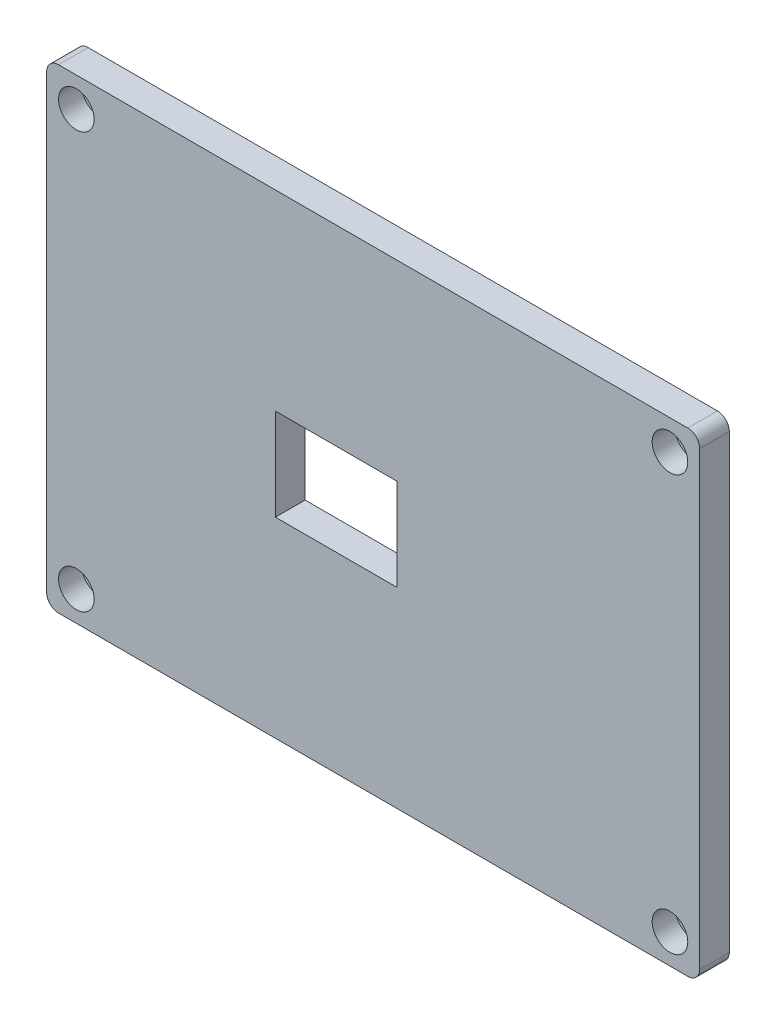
ISO-10303-21;
HEADER;
FILE_DESCRIPTION(('STEP AP214'),'2;1');
FILE_NAME('part.step','',(''),(''),'','','');
FILE_SCHEMA(('AUTOMOTIVE_DESIGN { 1 0 10303 214 1 1 1 1 }'));
ENDSEC;
DATA;
#1=APPLICATION_CONTEXT('core data for automotive mechanical design processes');
#2=APPLICATION_PROTOCOL_DEFINITION('international standard','automotive_design',2000,#1);
#3=PRODUCT_CONTEXT('',#1,'mechanical');
#4=PRODUCT('Part','Part','',(#3));
#5=PRODUCT_RELATED_PRODUCT_CATEGORY('part','',(#4));
#6=PRODUCT_DEFINITION_FORMATION('','',#4);
#7=PRODUCT_DEFINITION_CONTEXT('part definition',#1,'design');
#8=PRODUCT_DEFINITION('design','',#6,#7);
#9=PRODUCT_DEFINITION_SHAPE('','',#8);
#10=(LENGTH_UNIT() NAMED_UNIT(*) SI_UNIT(.MILLI.,.METRE.));
#11=(NAMED_UNIT(*) PLANE_ANGLE_UNIT() SI_UNIT($,.RADIAN.));
#12=(NAMED_UNIT(*) SI_UNIT($,.STERADIAN.) SOLID_ANGLE_UNIT());
#13=UNCERTAINTY_MEASURE_WITH_UNIT(LENGTH_MEASURE(1.E-05),#10,'distance_accuracy_value','');
#14=(GEOMETRIC_REPRESENTATION_CONTEXT(3) GLOBAL_UNCERTAINTY_ASSIGNED_CONTEXT((#13)) GLOBAL_UNIT_ASSIGNED_CONTEXT((#10,
#11,#12)) REPRESENTATION_CONTEXT('',''));
#15=CARTESIAN_POINT('',(0.,0.,0.));
#16=DIRECTION('',(0.,0.,1.));
#17=DIRECTION('',(1.,0.,0.));
#18=AXIS2_PLACEMENT_3D('',#15,#16,#17);
#19=CARTESIAN_POINT('',(-63.5,44.45,6.35));
#20=DIRECTION('',(0.,0.,-1.));
#21=DIRECTION('',(-1.,0.,0.));
#22=AXIS2_PLACEMENT_3D('',#19,#20,#21);
#23=CYLINDRICAL_SURFACE('',#22,2.47650000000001);
#24=CARTESIAN_POINT('',(-63.5,44.45,0.));
#25=DIRECTION('',(0.,0.,1.));
#26=DIRECTION('',(1.,0.,0.));
#27=AXIS2_PLACEMENT_3D('',#24,#25,#26);
#28=CIRCLE('',#27,2.47650000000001);
#29=CARTESIAN_POINT('',(-61.0235,44.45,0.));
#30=VERTEX_POINT('',#29);
#31=EDGE_CURVE('E197',#30,#30,#28,.T.);
#32=ORIENTED_EDGE('',*,*,#31,.F.);
#33=EDGE_LOOP('',(#32));
#34=FACE_BOUND('',#33,.T.);
#35=CARTESIAN_POINT('',(-63.5,44.45,1.397));
#36=DIRECTION('',(0.,0.,1.));
#37=DIRECTION('',(1.,0.,0.));
#38=AXIS2_PLACEMENT_3D('',#35,#36,#37);
#39=CIRCLE('',#38,2.47650000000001);
#40=CARTESIAN_POINT('',(-61.0235,44.45,1.397));
#41=VERTEX_POINT('',#40);
#42=EDGE_CURVE('E191',#41,#41,#39,.T.);
#43=ORIENTED_EDGE('',*,*,#42,.T.);
#44=EDGE_LOOP('',(#43));
#45=FACE_BOUND('',#44,.T.);
#46=ADVANCED_FACE('F35',(#34,#45),#23,.F.);
#47=CARTESIAN_POINT('',(63.5,44.45,6.35));
#48=DIRECTION('',(0.,0.,-1.));
#49=DIRECTION('',(-1.,0.,0.));
#50=AXIS2_PLACEMENT_3D('',#47,#48,#49);
#51=CYLINDRICAL_SURFACE('',#50,2.4765);
#52=CARTESIAN_POINT('',(63.5,44.45,0.));
#53=DIRECTION('',(0.,0.,1.));
#54=DIRECTION('',(1.,0.,0.));
#55=AXIS2_PLACEMENT_3D('',#52,#53,#54);
#56=CIRCLE('',#55,2.4765);
#57=CARTESIAN_POINT('',(65.9765,44.45,0.));
#58=VERTEX_POINT('',#57);
#59=EDGE_CURVE('E194',#58,#58,#56,.T.);
#60=ORIENTED_EDGE('',*,*,#59,.F.);
#61=EDGE_LOOP('',(#60));
#62=FACE_BOUND('',#61,.T.);
#63=CARTESIAN_POINT('',(63.5,44.45,1.397));
#64=DIRECTION('',(0.,0.,1.));
#65=DIRECTION('',(1.,0.,0.));
#66=AXIS2_PLACEMENT_3D('',#63,#64,#65);
#67=CIRCLE('',#66,2.4765);
#68=CARTESIAN_POINT('',(65.9765,44.45,1.397));
#69=VERTEX_POINT('',#68);
#70=EDGE_CURVE('E230',#69,#69,#67,.T.);
#71=ORIENTED_EDGE('',*,*,#70,.T.);
#72=EDGE_LOOP('',(#71));
#73=FACE_BOUND('',#72,.T.);
#74=ADVANCED_FACE('F310',(#62,#73),#51,.F.);
#75=CARTESIAN_POINT('',(63.5,-44.45,6.35));
#76=DIRECTION('',(0.,0.,-1.));
#77=DIRECTION('',(-1.,0.,0.));
#78=AXIS2_PLACEMENT_3D('',#75,#76,#77);
#79=CYLINDRICAL_SURFACE('',#78,2.4765);
#80=CARTESIAN_POINT('',(63.5,-44.45,0.));
#81=DIRECTION('',(0.,0.,1.));
#82=DIRECTION('',(1.,0.,0.));
#83=AXIS2_PLACEMENT_3D('',#80,#81,#82);
#84=CIRCLE('',#83,2.4765);
#85=CARTESIAN_POINT('',(65.9765,-44.45,0.));
#86=VERTEX_POINT('',#85);
#87=EDGE_CURVE('E190',#86,#86,#84,.T.);
#88=ORIENTED_EDGE('',*,*,#87,.F.);
#89=EDGE_LOOP('',(#88));
#90=FACE_BOUND('',#89,.T.);
#91=CARTESIAN_POINT('',(63.5,-44.45,1.397));
#92=DIRECTION('',(0.,0.,1.));
#93=DIRECTION('',(1.,0.,0.));
#94=AXIS2_PLACEMENT_3D('',#91,#92,#93);
#95=CIRCLE('',#94,2.4765);
#96=CARTESIAN_POINT('',(65.9765,-44.45,1.397));
#97=VERTEX_POINT('',#96);
#98=EDGE_CURVE('E227',#97,#97,#95,.T.);
#99=ORIENTED_EDGE('',*,*,#98,.T.);
#100=EDGE_LOOP('',(#99));
#101=FACE_BOUND('',#100,.T.);
#102=ADVANCED_FACE('F316',(#90,#101),#79,.F.);
#103=CARTESIAN_POINT('',(-63.5,-44.45,6.35));
#104=DIRECTION('',(0.,0.,-1.));
#105=DIRECTION('',(-1.,0.,0.));
#106=AXIS2_PLACEMENT_3D('',#103,#104,#105);
#107=CYLINDRICAL_SURFACE('',#106,2.47650000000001);
#108=CARTESIAN_POINT('',(-63.5,-44.45,0.));
#109=DIRECTION('',(0.,0.,1.));
#110=DIRECTION('',(1.,0.,0.));
#111=AXIS2_PLACEMENT_3D('',#108,#109,#110);
#112=CIRCLE('',#111,2.47650000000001);
#113=CARTESIAN_POINT('',(-61.0235,-44.45,0.));
#114=VERTEX_POINT('',#113);
#115=EDGE_CURVE('E187',#114,#114,#112,.T.);
#116=ORIENTED_EDGE('',*,*,#115,.F.);
#117=EDGE_LOOP('',(#116));
#118=FACE_BOUND('',#117,.T.);
#119=CARTESIAN_POINT('',(-63.5,-44.45,1.397));
#120=DIRECTION('',(0.,0.,1.));
#121=DIRECTION('',(1.,0.,0.));
#122=AXIS2_PLACEMENT_3D('',#119,#120,#121);
#123=CIRCLE('',#122,2.47650000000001);
#124=CARTESIAN_POINT('',(-61.0235,-44.45,1.397));
#125=VERTEX_POINT('',#124);
#126=EDGE_CURVE('E184',#125,#125,#123,.T.);
#127=ORIENTED_EDGE('',*,*,#126,.T.);
#128=EDGE_LOOP('',(#127));
#129=FACE_BOUND('',#128,.T.);
#130=ADVANCED_FACE('F325',(#118,#129),#107,.F.);
#131=CARTESIAN_POINT('',(0.,0.,6.35));
#132=DIRECTION('',(0.,0.,-1.));
#133=DIRECTION('',(-1.,0.,0.));
#134=AXIS2_PLACEMENT_3D('',#131,#132,#133);
#135=PLANE('',#134);
#136=DIRECTION('',(-1.,0.,0.));
#137=VECTOR('',#136,1.);
#138=CARTESIAN_POINT('',(0.,-9.8298,6.35));
#139=LINE('',#138,#137);
#140=CARTESIAN_POINT('',(5.10300896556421,-9.8298,6.35));
#141=VERTEX_POINT('',#140);
#142=CARTESIAN_POINT('',(-20.915750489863,-9.8298,6.35));
#143=VERTEX_POINT('',#142);
#144=EDGE_CURVE('E149',#141,#143,#139,.T.);
#145=ORIENTED_EDGE('',*,*,#144,.T.);
#146=DIRECTION('',(0.,1.,0.));
#147=VECTOR('',#146,1.);
#148=CARTESIAN_POINT('',(-20.915750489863,0.,6.35));
#149=LINE('',#148,#147);
#150=CARTESIAN_POINT('',(-20.915750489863,9.8298,6.35));
#151=VERTEX_POINT('',#150);
#152=EDGE_CURVE('E130',#143,#151,#149,.T.);
#153=ORIENTED_EDGE('',*,*,#152,.T.);
#154=DIRECTION('',(1.,0.,0.));
#155=VECTOR('',#154,1.);
#156=CARTESIAN_POINT('',(0.,9.8298,6.35));
#157=LINE('',#156,#155);
#158=CARTESIAN_POINT('',(5.10300896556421,9.8298,6.35));
#159=VERTEX_POINT('',#158);
#160=EDGE_CURVE('E158',#151,#159,#157,.T.);
#161=ORIENTED_EDGE('',*,*,#160,.T.);
#162=DIRECTION('',(0.,-1.,0.));
#163=VECTOR('',#162,1.);
#164=CARTESIAN_POINT('',(5.10300896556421,0.,6.35));
#165=LINE('',#164,#163);
#166=EDGE_CURVE('E155',#159,#141,#165,.T.);
#167=ORIENTED_EDGE('',*,*,#166,.T.);
#168=EDGE_LOOP('',(#145,#153,#161,#167));
#169=FACE_BOUND('',#168,.T.);
#170=CARTESIAN_POINT('',(63.5,-44.45,6.35));
#171=DIRECTION('',(0.,0.,1.));
#172=DIRECTION('',(1.,0.,0.));
#173=AXIS2_PLACEMENT_3D('',#170,#171,#172);
#174=CIRCLE('',#173,3.81);
#175=CARTESIAN_POINT('',(67.31,-44.45,6.35));
#176=VERTEX_POINT('',#175);
#177=EDGE_CURVE('E162',#176,#176,#174,.T.);
#178=ORIENTED_EDGE('',*,*,#177,.F.);
#179=EDGE_LOOP('',(#178));
#180=FACE_BOUND('',#179,.T.);
#181=CARTESIAN_POINT('',(63.5,44.45,6.35));
#182=DIRECTION('',(0.,0.,1.));
#183=DIRECTION('',(1.,0.,0.));
#184=AXIS2_PLACEMENT_3D('',#181,#182,#183);
#185=CIRCLE('',#184,3.81);
#186=CARTESIAN_POINT('',(67.31,44.45,6.35));
#187=VERTEX_POINT('',#186);
#188=EDGE_CURVE('E173',#187,#187,#185,.T.);
#189=ORIENTED_EDGE('',*,*,#188,.F.);
#190=EDGE_LOOP('',(#189));
#191=FACE_BOUND('',#190,.T.);
#192=CARTESIAN_POINT('',(-63.5,44.45,6.35));
#193=DIRECTION('',(0.,0.,1.));
#194=DIRECTION('',(1.,0.,0.));
#195=AXIS2_PLACEMENT_3D('',#192,#193,#194);
#196=CIRCLE('',#195,3.81);
#197=CARTESIAN_POINT('',(-59.69,44.45,6.35));
#198=VERTEX_POINT('',#197);
#199=EDGE_CURVE('E167',#198,#198,#196,.T.);
#200=ORIENTED_EDGE('',*,*,#199,.F.);
#201=EDGE_LOOP('',(#200));
#202=FACE_BOUND('',#201,.T.);
#203=CARTESIAN_POINT('',(-63.5,-44.45,6.35));
#204=DIRECTION('',(0.,0.,1.));
#205=DIRECTION('',(1.,0.,0.));
#206=AXIS2_PLACEMENT_3D('',#203,#204,#205);
#207=CIRCLE('',#206,3.81);
#208=CARTESIAN_POINT('',(-59.69,-44.45,6.35));
#209=VERTEX_POINT('',#208);
#210=EDGE_CURVE('E166',#209,#209,#207,.T.);
#211=ORIENTED_EDGE('',*,*,#210,.F.);
#212=EDGE_LOOP('',(#211));
#213=FACE_BOUND('',#212,.T.);
#214=DIRECTION('',(0.,1.,0.));
#215=VECTOR('',#214,1.);
#216=CARTESIAN_POINT('',(69.85,-50.8,6.35));
#217=LINE('',#216,#215);
#218=CARTESIAN_POINT('',(69.85,-48.26,6.35));
#219=VERTEX_POINT('',#218);
#220=CARTESIAN_POINT('',(69.85,48.26,6.35));
#221=VERTEX_POINT('',#220);
#222=EDGE_CURVE('E201',#219,#221,#217,.T.);
#223=ORIENTED_EDGE('',*,*,#222,.T.);
#224=CARTESIAN_POINT('',(67.31,48.26,6.35));
#225=DIRECTION('',(0.,0.,-1.));
#226=DIRECTION('',(-1.,0.,0.));
#227=AXIS2_PLACEMENT_3D('',#224,#225,#226);
#228=CIRCLE('',#227,2.54);
#229=CARTESIAN_POINT('',(67.31,50.8,6.35));
#230=VERTEX_POINT('',#229);
#231=EDGE_CURVE('E258',#221,#230,#228,.F.);
#232=ORIENTED_EDGE('',*,*,#231,.T.);
#233=DIRECTION('',(-1.,0.,0.));
#234=VECTOR('',#233,1.);
#235=CARTESIAN_POINT('',(-69.85,50.8,6.35));
#236=LINE('',#235,#234);
#237=CARTESIAN_POINT('',(-67.31,50.8,6.35));
#238=VERTEX_POINT('',#237);
#239=EDGE_CURVE('E204',#230,#238,#236,.T.);
#240=ORIENTED_EDGE('',*,*,#239,.T.);
#241=CARTESIAN_POINT('',(-67.31,48.26,6.35));
#242=DIRECTION('',(0.,0.,-1.));
#243=DIRECTION('',(-1.,0.,0.));
#244=AXIS2_PLACEMENT_3D('',#241,#242,#243);
#245=CIRCLE('',#244,2.54);
#246=CARTESIAN_POINT('',(-69.85,48.26,6.35));
#247=VERTEX_POINT('',#246);
#248=EDGE_CURVE('E256',#238,#247,#245,.F.);
#249=ORIENTED_EDGE('',*,*,#248,.T.);
#250=DIRECTION('',(0.,-1.,0.));
#251=VECTOR('',#250,1.);
#252=CARTESIAN_POINT('',(-69.85,-50.8,6.35));
#253=LINE('',#252,#251);
#254=CARTESIAN_POINT('',(-69.85,-48.26,6.35));
#255=VERTEX_POINT('',#254);
#256=EDGE_CURVE('E208',#247,#255,#253,.T.);
#257=ORIENTED_EDGE('',*,*,#256,.T.);
#258=CARTESIAN_POINT('',(-67.31,-48.26,6.35));
#259=DIRECTION('',(0.,0.,-1.));
#260=DIRECTION('',(-1.,0.,0.));
#261=AXIS2_PLACEMENT_3D('',#258,#259,#260);
#262=CIRCLE('',#261,2.54);
#263=CARTESIAN_POINT('',(-67.31,-50.8,6.35));
#264=VERTEX_POINT('',#263);
#265=EDGE_CURVE('E254',#255,#264,#262,.F.);
#266=ORIENTED_EDGE('',*,*,#265,.T.);
#267=DIRECTION('',(1.,0.,0.));
#268=VECTOR('',#267,1.);
#269=CARTESIAN_POINT('',(-69.85,-50.8,6.35));
#270=LINE('',#269,#268);
#271=CARTESIAN_POINT('',(67.31,-50.8,6.35));
#272=VERTEX_POINT('',#271);
#273=EDGE_CURVE('E211',#264,#272,#270,.T.);
#274=ORIENTED_EDGE('',*,*,#273,.T.);
#275=CARTESIAN_POINT('',(67.31,-48.26,6.35));
#276=DIRECTION('',(0.,0.,-1.));
#277=DIRECTION('',(-1.,0.,0.));
#278=AXIS2_PLACEMENT_3D('',#275,#276,#277);
#279=CIRCLE('',#278,2.54);
#280=EDGE_CURVE('E252',#272,#219,#279,.F.);
#281=ORIENTED_EDGE('',*,*,#280,.T.);
#282=EDGE_LOOP('',(#223,#232,#240,#249,#257,#266,#274,#281));
#283=FACE_BOUND('',#282,.T.);
#284=ADVANCED_FACE('F273',(#169,#180,#191,#202,#213,#283),#135,.F.);
#285=CARTESIAN_POINT('',(0.,0.,0.));
#286=DIRECTION('',(0.,0.,-1.));
#287=DIRECTION('',(-1.,0.,0.));
#288=AXIS2_PLACEMENT_3D('',#285,#286,#287);
#289=PLANE('',#288);
#290=DIRECTION('',(0.,-1.,0.));
#291=VECTOR('',#290,1.);
#292=CARTESIAN_POINT('',(-20.915750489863,9.8298,0.));
#293=LINE('',#292,#291);
#294=CARTESIAN_POINT('',(-20.915750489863,9.8298,0.));
#295=VERTEX_POINT('',#294);
#296=CARTESIAN_POINT('',(-20.915750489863,-9.8298,0.));
#297=VERTEX_POINT('',#296);
#298=EDGE_CURVE('E127',#295,#297,#293,.T.);
#299=ORIENTED_EDGE('',*,*,#298,.T.);
#300=DIRECTION('',(1.,0.,0.));
#301=VECTOR('',#300,1.);
#302=CARTESIAN_POINT('',(-20.915750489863,-9.8298,0.));
#303=LINE('',#302,#301);
#304=CARTESIAN_POINT('',(5.10300896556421,-9.8298,0.));
#305=VERTEX_POINT('',#304);
#306=EDGE_CURVE('E136',#297,#305,#303,.T.);
#307=ORIENTED_EDGE('',*,*,#306,.T.);
#308=DIRECTION('',(0.,1.,0.));
#309=VECTOR('',#308,1.);
#310=CARTESIAN_POINT('',(5.10300896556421,9.8298,0.));
#311=LINE('',#310,#309);
#312=CARTESIAN_POINT('',(5.10300896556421,9.8298,0.));
#313=VERTEX_POINT('',#312);
#314=EDGE_CURVE('E58',#305,#313,#311,.T.);
#315=ORIENTED_EDGE('',*,*,#314,.T.);
#316=DIRECTION('',(-1.,0.,0.));
#317=VECTOR('',#316,1.);
#318=CARTESIAN_POINT('',(-20.915750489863,9.8298,0.));
#319=LINE('',#318,#317);
#320=EDGE_CURVE('E133',#313,#295,#319,.T.);
#321=ORIENTED_EDGE('',*,*,#320,.T.);
#322=EDGE_LOOP('',(#299,#307,#315,#321));
#323=FACE_BOUND('',#322,.T.);
#324=ORIENTED_EDGE('',*,*,#87,.T.);
#325=EDGE_LOOP('',(#324));
#326=FACE_BOUND('',#325,.T.);
#327=ORIENTED_EDGE('',*,*,#31,.T.);
#328=EDGE_LOOP('',(#327));
#329=FACE_BOUND('',#328,.T.);
#330=DIRECTION('',(-1.,0.,0.));
#331=VECTOR('',#330,1.);
#332=CARTESIAN_POINT('',(-69.85,50.8,0.));
#333=LINE('',#332,#331);
#334=CARTESIAN_POINT('',(67.31,50.8,0.));
#335=VERTEX_POINT('',#334);
#336=CARTESIAN_POINT('',(-67.31,50.8,0.));
#337=VERTEX_POINT('',#336);
#338=EDGE_CURVE('E217',#335,#337,#333,.T.);
#339=ORIENTED_EDGE('',*,*,#338,.F.);
#340=CARTESIAN_POINT('',(67.31,48.26,0.));
#341=DIRECTION('',(0.,0.,-1.));
#342=DIRECTION('',(-1.,0.,0.));
#343=AXIS2_PLACEMENT_3D('',#340,#341,#342);
#344=CIRCLE('',#343,2.54);
#345=CARTESIAN_POINT('',(69.85,48.26,0.));
#346=VERTEX_POINT('',#345);
#347=EDGE_CURVE('E245',#335,#346,#344,.T.);
#348=ORIENTED_EDGE('',*,*,#347,.T.);
#349=DIRECTION('',(0.,1.,0.));
#350=VECTOR('',#349,1.);
#351=CARTESIAN_POINT('',(69.85,-50.8,0.));
#352=LINE('',#351,#350);
#353=CARTESIAN_POINT('',(69.85,-48.26,0.));
#354=VERTEX_POINT('',#353);
#355=EDGE_CURVE('E200',#354,#346,#352,.T.);
#356=ORIENTED_EDGE('',*,*,#355,.F.);
#357=CARTESIAN_POINT('',(67.31,-48.26,0.));
#358=DIRECTION('',(0.,0.,-1.));
#359=DIRECTION('',(-1.,0.,0.));
#360=AXIS2_PLACEMENT_3D('',#357,#358,#359);
#361=CIRCLE('',#360,2.54);
#362=CARTESIAN_POINT('',(67.31,-50.8,0.));
#363=VERTEX_POINT('',#362);
#364=EDGE_CURVE('E239',#354,#363,#361,.T.);
#365=ORIENTED_EDGE('',*,*,#364,.T.);
#366=DIRECTION('',(1.,0.,0.));
#367=VECTOR('',#366,1.);
#368=CARTESIAN_POINT('',(-69.85,-50.8,0.));
#369=LINE('',#368,#367);
#370=CARTESIAN_POINT('',(-67.31,-50.8,0.));
#371=VERTEX_POINT('',#370);
#372=EDGE_CURVE('E205',#371,#363,#369,.T.);
#373=ORIENTED_EDGE('',*,*,#372,.F.);
#374=CARTESIAN_POINT('',(-67.31,-48.26,0.));
#375=DIRECTION('',(0.,0.,-1.));
#376=DIRECTION('',(-1.,0.,0.));
#377=AXIS2_PLACEMENT_3D('',#374,#375,#376);
#378=CIRCLE('',#377,2.54);
#379=CARTESIAN_POINT('',(-69.85,-48.26,0.));
#380=VERTEX_POINT('',#379);
#381=EDGE_CURVE('E241',#371,#380,#378,.T.);
#382=ORIENTED_EDGE('',*,*,#381,.T.);
#383=DIRECTION('',(0.,-1.,0.));
#384=VECTOR('',#383,1.);
#385=CARTESIAN_POINT('',(-69.85,-50.8,0.));
#386=LINE('',#385,#384);
#387=CARTESIAN_POINT('',(-69.85,48.26,0.));
#388=VERTEX_POINT('',#387);
#389=EDGE_CURVE('E220',#388,#380,#386,.T.);
#390=ORIENTED_EDGE('',*,*,#389,.F.);
#391=CARTESIAN_POINT('',(-67.31,48.26,0.));
#392=DIRECTION('',(0.,0.,-1.));
#393=DIRECTION('',(-1.,0.,0.));
#394=AXIS2_PLACEMENT_3D('',#391,#392,#393);
#395=CIRCLE('',#394,2.54);
#396=EDGE_CURVE('E243',#388,#337,#395,.T.);
#397=ORIENTED_EDGE('',*,*,#396,.T.);
#398=EDGE_LOOP('',(#339,#348,#356,#365,#373,#382,#390,#397));
#399=FACE_BOUND('',#398,.T.);
#400=ORIENTED_EDGE('',*,*,#59,.T.);
#401=EDGE_LOOP('',(#400));
#402=FACE_BOUND('',#401,.T.);
#403=ORIENTED_EDGE('',*,*,#115,.T.);
#404=EDGE_LOOP('',(#403));
#405=FACE_BOUND('',#404,.T.);
#406=ADVANCED_FACE('F140',(#323,#326,#329,#399,#402,#405),#289,.T.);
#407=CARTESIAN_POINT('',(69.85,-50.8,6.35));
#408=DIRECTION('',(-1.,0.,0.));
#409=DIRECTION('',(0.,0.,1.));
#410=AXIS2_PLACEMENT_3D('',#407,#408,#409);
#411=PLANE('',#410);
#412=ORIENTED_EDGE('',*,*,#355,.T.);
#413=DIRECTION('',(0.,0.,-1.));
#414=VECTOR('',#413,1.);
#415=CARTESIAN_POINT('',(69.85,48.26,6.35));
#416=LINE('',#415,#414);
#417=EDGE_CURVE('E250',#346,#221,#416,.F.);
#418=ORIENTED_EDGE('',*,*,#417,.T.);
#419=ORIENTED_EDGE('',*,*,#222,.F.);
#420=DIRECTION('',(0.,0.,-1.));
#421=VECTOR('',#420,1.);
#422=CARTESIAN_POINT('',(69.85,-48.26,6.35));
#423=LINE('',#422,#421);
#424=EDGE_CURVE('E247',#219,#354,#423,.T.);
#425=ORIENTED_EDGE('',*,*,#424,.T.);
#426=EDGE_LOOP('',(#412,#418,#419,#425));
#427=FACE_BOUND('',#426,.T.);
#428=ADVANCED_FACE('F279',(#427),#411,.F.);
#429=CARTESIAN_POINT('',(-69.85,50.8,6.35));
#430=DIRECTION('',(0.,-1.,0.));
#431=DIRECTION('',(0.,0.,-1.));
#432=AXIS2_PLACEMENT_3D('',#429,#430,#431);
#433=PLANE('',#432);
#434=ORIENTED_EDGE('',*,*,#239,.F.);
#435=DIRECTION('',(0.,0.,-1.));
#436=VECTOR('',#435,1.);
#437=CARTESIAN_POINT('',(67.31,50.8,6.35));
#438=LINE('',#437,#436);
#439=EDGE_CURVE('E236',#230,#335,#438,.T.);
#440=ORIENTED_EDGE('',*,*,#439,.T.);
#441=ORIENTED_EDGE('',*,*,#338,.T.);
#442=DIRECTION('',(0.,0.,-1.));
#443=VECTOR('',#442,1.);
#444=CARTESIAN_POINT('',(-67.31,50.8,6.35));
#445=LINE('',#444,#443);
#446=EDGE_CURVE('E214',#337,#238,#445,.F.);
#447=ORIENTED_EDGE('',*,*,#446,.T.);
#448=EDGE_LOOP('',(#434,#440,#441,#447));
#449=FACE_BOUND('',#448,.T.);
#450=ADVANCED_FACE('F290',(#449),#433,.F.);
#451=CARTESIAN_POINT('',(-69.85,-50.8,6.35));
#452=DIRECTION('',(1.,0.,0.));
#453=DIRECTION('',(0.,0.,-1.));
#454=AXIS2_PLACEMENT_3D('',#451,#452,#453);
#455=PLANE('',#454);
#456=ORIENTED_EDGE('',*,*,#256,.F.);
#457=DIRECTION('',(0.,0.,-1.));
#458=VECTOR('',#457,1.);
#459=CARTESIAN_POINT('',(-69.85,48.26,6.35));
#460=LINE('',#459,#458);
#461=EDGE_CURVE('E262',#247,#388,#460,.T.);
#462=ORIENTED_EDGE('',*,*,#461,.T.);
#463=ORIENTED_EDGE('',*,*,#389,.T.);
#464=DIRECTION('',(0.,0.,-1.));
#465=VECTOR('',#464,1.);
#466=CARTESIAN_POINT('',(-69.85,-48.26,6.35));
#467=LINE('',#466,#465);
#468=EDGE_CURVE('E260',#380,#255,#467,.F.);
#469=ORIENTED_EDGE('',*,*,#468,.T.);
#470=EDGE_LOOP('',(#456,#462,#463,#469));
#471=FACE_BOUND('',#470,.T.);
#472=ADVANCED_FACE('F299',(#471),#455,.F.);
#473=CARTESIAN_POINT('',(-69.85,-50.8,6.35));
#474=DIRECTION('',(0.,1.,0.));
#475=DIRECTION('',(0.,0.,1.));
#476=AXIS2_PLACEMENT_3D('',#473,#474,#475);
#477=PLANE('',#476);
#478=ORIENTED_EDGE('',*,*,#273,.F.);
#479=DIRECTION('',(0.,0.,-1.));
#480=VECTOR('',#479,1.);
#481=CARTESIAN_POINT('',(-67.31,-50.8,6.35));
#482=LINE('',#481,#480);
#483=EDGE_CURVE('E11',#264,#371,#482,.T.);
#484=ORIENTED_EDGE('',*,*,#483,.T.);
#485=ORIENTED_EDGE('',*,*,#372,.T.);
#486=DIRECTION('',(0.,0.,-1.));
#487=VECTOR('',#486,1.);
#488=CARTESIAN_POINT('',(67.31,-50.8,6.35));
#489=LINE('',#488,#487);
#490=EDGE_CURVE('E43',#363,#272,#489,.F.);
#491=ORIENTED_EDGE('',*,*,#490,.T.);
#492=EDGE_LOOP('',(#478,#484,#485,#491));
#493=FACE_BOUND('',#492,.T.);
#494=ADVANCED_FACE('F267',(#493),#477,.F.);
#495=CARTESIAN_POINT('',(-63.5,-44.45,1.397));
#496=DIRECTION('',(0.,0.,1.));
#497=DIRECTION('',(1.,0.,0.));
#498=AXIS2_PLACEMENT_3D('',#495,#496,#497);
#499=CYLINDRICAL_SURFACE('',#498,3.81);
#500=CARTESIAN_POINT('',(-63.5,-44.45,1.397));
#501=DIRECTION('',(0.,0.,1.));
#502=DIRECTION('',(1.,0.,0.));
#503=AXIS2_PLACEMENT_3D('',#500,#501,#502);
#504=CIRCLE('',#503,3.81);
#505=CARTESIAN_POINT('',(-59.69,-44.45,1.397));
#506=VERTEX_POINT('',#505);
#507=EDGE_CURVE('E181',#506,#506,#504,.T.);
#508=ORIENTED_EDGE('',*,*,#507,.F.);
#509=EDGE_LOOP('',(#508));
#510=FACE_BOUND('',#509,.T.);
#511=ORIENTED_EDGE('',*,*,#210,.T.);
#512=EDGE_LOOP('',(#511));
#513=FACE_BOUND('',#512,.T.);
#514=ADVANCED_FACE('F331',(#510,#513),#499,.F.);
#515=CARTESIAN_POINT('',(-63.5,-44.45,1.397));
#516=DIRECTION('',(0.,0.,1.));
#517=DIRECTION('',(1.,0.,0.));
#518=AXIS2_PLACEMENT_3D('',#515,#516,#517);
#519=PLANE('',#518);
#520=ORIENTED_EDGE('',*,*,#126,.F.);
#521=EDGE_LOOP('',(#520));
#522=FACE_BOUND('',#521,.T.);
#523=ORIENTED_EDGE('',*,*,#507,.T.);
#524=EDGE_LOOP('',(#523));
#525=FACE_BOUND('',#524,.T.);
#526=ADVANCED_FACE('F371',(#522,#525),#519,.T.);
#527=CARTESIAN_POINT('',(63.5,-44.45,1.397));
#528=DIRECTION('',(0.,0.,1.));
#529=DIRECTION('',(1.,0.,0.));
#530=AXIS2_PLACEMENT_3D('',#527,#528,#529);
#531=CYLINDRICAL_SURFACE('',#530,3.81);
#532=CARTESIAN_POINT('',(63.5,-44.45,1.397));
#533=DIRECTION('',(0.,0.,1.));
#534=DIRECTION('',(1.,0.,0.));
#535=AXIS2_PLACEMENT_3D('',#532,#533,#534);
#536=CIRCLE('',#535,3.81);
#537=CARTESIAN_POINT('',(67.31,-44.45,1.397));
#538=VERTEX_POINT('',#537);
#539=EDGE_CURVE('E176',#538,#538,#536,.T.);
#540=ORIENTED_EDGE('',*,*,#539,.F.);
#541=EDGE_LOOP('',(#540));
#542=FACE_BOUND('',#541,.T.);
#543=ORIENTED_EDGE('',*,*,#177,.T.);
#544=EDGE_LOOP('',(#543));
#545=FACE_BOUND('',#544,.T.);
#546=ADVANCED_FACE('F367',(#542,#545),#531,.F.);
#547=CARTESIAN_POINT('',(63.5,-44.45,1.397));
#548=DIRECTION('',(0.,0.,1.));
#549=DIRECTION('',(1.,0.,0.));
#550=AXIS2_PLACEMENT_3D('',#547,#548,#549);
#551=PLANE('',#550);
#552=ORIENTED_EDGE('',*,*,#98,.F.);
#553=EDGE_LOOP('',(#552));
#554=FACE_BOUND('',#553,.T.);
#555=ORIENTED_EDGE('',*,*,#539,.T.);
#556=EDGE_LOOP('',(#555));
#557=FACE_BOUND('',#556,.T.);
#558=ADVANCED_FACE('F363',(#554,#557),#551,.T.);
#559=CARTESIAN_POINT('',(63.5,44.45,1.397));
#560=DIRECTION('',(0.,0.,1.));
#561=DIRECTION('',(1.,0.,0.));
#562=AXIS2_PLACEMENT_3D('',#559,#560,#561);
#563=CYLINDRICAL_SURFACE('',#562,3.81);
#564=CARTESIAN_POINT('',(63.5,44.45,1.397));
#565=DIRECTION('',(0.,0.,1.));
#566=DIRECTION('',(1.,0.,0.));
#567=AXIS2_PLACEMENT_3D('',#564,#565,#566);
#568=CIRCLE('',#567,3.81);
#569=CARTESIAN_POINT('',(67.31,44.45,1.397));
#570=VERTEX_POINT('',#569);
#571=EDGE_CURVE('E170',#570,#570,#568,.T.);
#572=ORIENTED_EDGE('',*,*,#571,.F.);
#573=EDGE_LOOP('',(#572));
#574=FACE_BOUND('',#573,.T.);
#575=ORIENTED_EDGE('',*,*,#188,.T.);
#576=EDGE_LOOP('',(#575));
#577=FACE_BOUND('',#576,.T.);
#578=ADVANCED_FACE('F359',(#574,#577),#563,.F.);
#579=CARTESIAN_POINT('',(63.5,44.45,1.397));
#580=DIRECTION('',(0.,0.,1.));
#581=DIRECTION('',(1.,0.,0.));
#582=AXIS2_PLACEMENT_3D('',#579,#580,#581);
#583=PLANE('',#582);
#584=ORIENTED_EDGE('',*,*,#70,.F.);
#585=EDGE_LOOP('',(#584));
#586=FACE_BOUND('',#585,.T.);
#587=ORIENTED_EDGE('',*,*,#571,.T.);
#588=EDGE_LOOP('',(#587));
#589=FACE_BOUND('',#588,.T.);
#590=ADVANCED_FACE('F349',(#586,#589),#583,.T.);
#591=CARTESIAN_POINT('',(-63.5,44.45,1.397));
#592=DIRECTION('',(0.,0.,1.));
#593=DIRECTION('',(1.,0.,0.));
#594=AXIS2_PLACEMENT_3D('',#591,#592,#593);
#595=CYLINDRICAL_SURFACE('',#594,3.81);
#596=CARTESIAN_POINT('',(-63.5,44.45,1.397));
#597=DIRECTION('',(0.,0.,1.));
#598=DIRECTION('',(1.,0.,0.));
#599=AXIS2_PLACEMENT_3D('',#596,#597,#598);
#600=CIRCLE('',#599,3.81);
#601=CARTESIAN_POINT('',(-59.69,44.45,1.397));
#602=VERTEX_POINT('',#601);
#603=EDGE_CURVE('E163',#602,#602,#600,.T.);
#604=ORIENTED_EDGE('',*,*,#603,.F.);
#605=EDGE_LOOP('',(#604));
#606=FACE_BOUND('',#605,.T.);
#607=ORIENTED_EDGE('',*,*,#199,.T.);
#608=EDGE_LOOP('',(#607));
#609=FACE_BOUND('',#608,.T.);
#610=ADVANCED_FACE('F343',(#606,#609),#595,.F.);
#611=CARTESIAN_POINT('',(-63.5,44.45,1.397));
#612=DIRECTION('',(0.,0.,1.));
#613=DIRECTION('',(1.,0.,0.));
#614=AXIS2_PLACEMENT_3D('',#611,#612,#613);
#615=PLANE('',#614);
#616=ORIENTED_EDGE('',*,*,#42,.F.);
#617=EDGE_LOOP('',(#616));
#618=FACE_BOUND('',#617,.T.);
#619=ORIENTED_EDGE('',*,*,#603,.T.);
#620=EDGE_LOOP('',(#619));
#621=FACE_BOUND('',#620,.T.);
#622=ADVANCED_FACE('F339',(#618,#621),#615,.T.);
#623=CARTESIAN_POINT('',(67.31,48.26,6.35));
#624=DIRECTION('',(0.,0.,-1.));
#625=DIRECTION('',(-1.,0.,0.));
#626=AXIS2_PLACEMENT_3D('',#623,#624,#625);
#627=CYLINDRICAL_SURFACE('',#626,2.54);
#628=ORIENTED_EDGE('',*,*,#231,.F.);
#629=ORIENTED_EDGE('',*,*,#417,.F.);
#630=ORIENTED_EDGE('',*,*,#347,.F.);
#631=ORIENTED_EDGE('',*,*,#439,.F.);
#632=EDGE_LOOP('',(#628,#629,#630,#631));
#633=FACE_BOUND('',#632,.T.);
#634=ADVANCED_FACE('F287',(#633),#627,.T.);
#635=CARTESIAN_POINT('',(-67.31,48.26,6.35));
#636=DIRECTION('',(0.,0.,-1.));
#637=DIRECTION('',(-1.,0.,0.));
#638=AXIS2_PLACEMENT_3D('',#635,#636,#637);
#639=CYLINDRICAL_SURFACE('',#638,2.54);
#640=ORIENTED_EDGE('',*,*,#248,.F.);
#641=ORIENTED_EDGE('',*,*,#446,.F.);
#642=ORIENTED_EDGE('',*,*,#396,.F.);
#643=ORIENTED_EDGE('',*,*,#461,.F.);
#644=EDGE_LOOP('',(#640,#641,#642,#643));
#645=FACE_BOUND('',#644,.T.);
#646=ADVANCED_FACE('F296',(#645),#639,.T.);
#647=CARTESIAN_POINT('',(-67.31,-48.26,6.35));
#648=DIRECTION('',(0.,0.,-1.));
#649=DIRECTION('',(-1.,0.,0.));
#650=AXIS2_PLACEMENT_3D('',#647,#648,#649);
#651=CYLINDRICAL_SURFACE('',#650,2.54);
#652=ORIENTED_EDGE('',*,*,#265,.F.);
#653=ORIENTED_EDGE('',*,*,#468,.F.);
#654=ORIENTED_EDGE('',*,*,#381,.F.);
#655=ORIENTED_EDGE('',*,*,#483,.F.);
#656=EDGE_LOOP('',(#652,#653,#654,#655));
#657=FACE_BOUND('',#656,.T.);
#658=ADVANCED_FACE('F302',(#657),#651,.T.);
#659=CARTESIAN_POINT('',(67.31,-48.26,6.35));
#660=DIRECTION('',(0.,0.,-1.));
#661=DIRECTION('',(-1.,0.,0.));
#662=AXIS2_PLACEMENT_3D('',#659,#660,#661);
#663=CYLINDRICAL_SURFACE('',#662,2.54);
#664=ORIENTED_EDGE('',*,*,#280,.F.);
#665=ORIENTED_EDGE('',*,*,#490,.F.);
#666=ORIENTED_EDGE('',*,*,#364,.F.);
#667=ORIENTED_EDGE('',*,*,#424,.F.);
#668=EDGE_LOOP('',(#664,#665,#666,#667));
#669=FACE_BOUND('',#668,.T.);
#670=ADVANCED_FACE('F37',(#669),#663,.T.);
#671=CARTESIAN_POINT('',(-20.915750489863,9.8298,0.));
#672=DIRECTION('',(-1.,0.,0.));
#673=DIRECTION('',(0.,-1.,0.));
#674=AXIS2_PLACEMENT_3D('',#671,#672,#673);
#675=PLANE('',#674);
#676=DIRECTION('',(0.,0.,1.));
#677=VECTOR('',#676,1.);
#678=CARTESIAN_POINT('',(-20.915750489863,-9.8298,0.));
#679=LINE('',#678,#677);
#680=EDGE_CURVE('E50',#297,#143,#679,.T.);
#681=ORIENTED_EDGE('',*,*,#680,.F.);
#682=ORIENTED_EDGE('',*,*,#298,.F.);
#683=DIRECTION('',(0.,0.,1.));
#684=VECTOR('',#683,1.);
#685=CARTESIAN_POINT('',(-20.915750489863,9.8298,0.));
#686=LINE('',#685,#684);
#687=EDGE_CURVE('E147',#295,#151,#686,.T.);
#688=ORIENTED_EDGE('',*,*,#687,.T.);
#689=ORIENTED_EDGE('',*,*,#152,.F.);
#690=EDGE_LOOP('',(#681,#682,#688,#689));
#691=FACE_BOUND('',#690,.T.);
#692=ADVANCED_FACE('F124',(#691),#675,.F.);
#693=CARTESIAN_POINT('',(-20.915750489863,9.8298,0.));
#694=DIRECTION('',(0.,1.,0.));
#695=DIRECTION('',(0.,0.,1.));
#696=AXIS2_PLACEMENT_3D('',#693,#694,#695);
#697=PLANE('',#696);
#698=ORIENTED_EDGE('',*,*,#687,.F.);
#699=ORIENTED_EDGE('',*,*,#320,.F.);
#700=DIRECTION('',(0.,0.,1.));
#701=VECTOR('',#700,1.);
#702=CARTESIAN_POINT('',(5.10300896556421,9.8298,0.));
#703=LINE('',#702,#701);
#704=EDGE_CURVE('E150',#313,#159,#703,.T.);
#705=ORIENTED_EDGE('',*,*,#704,.T.);
#706=ORIENTED_EDGE('',*,*,#160,.F.);
#707=EDGE_LOOP('',(#698,#699,#705,#706));
#708=FACE_BOUND('',#707,.T.);
#709=ADVANCED_FACE('F493',(#708),#697,.F.);
#710=CARTESIAN_POINT('',(5.10300896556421,9.8298,0.));
#711=DIRECTION('',(1.,0.,0.));
#712=DIRECTION('',(0.,1.,0.));
#713=AXIS2_PLACEMENT_3D('',#710,#711,#712);
#714=PLANE('',#713);
#715=ORIENTED_EDGE('',*,*,#704,.F.);
#716=ORIENTED_EDGE('',*,*,#314,.F.);
#717=DIRECTION('',(0.,0.,1.));
#718=VECTOR('',#717,1.);
#719=CARTESIAN_POINT('',(5.10300896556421,-9.8298,0.));
#720=LINE('',#719,#718);
#721=EDGE_CURVE('E132',#305,#141,#720,.T.);
#722=ORIENTED_EDGE('',*,*,#721,.T.);
#723=ORIENTED_EDGE('',*,*,#166,.F.);
#724=EDGE_LOOP('',(#715,#716,#722,#723));
#725=FACE_BOUND('',#724,.T.);
#726=ADVANCED_FACE('F500',(#725),#714,.F.);
#727=CARTESIAN_POINT('',(-20.915750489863,-9.8298,0.));
#728=DIRECTION('',(0.,-1.,0.));
#729=DIRECTION('',(1.,0.,0.));
#730=AXIS2_PLACEMENT_3D('',#727,#728,#729);
#731=PLANE('',#730);
#732=ORIENTED_EDGE('',*,*,#721,.F.);
#733=ORIENTED_EDGE('',*,*,#306,.F.);
#734=ORIENTED_EDGE('',*,*,#680,.T.);
#735=ORIENTED_EDGE('',*,*,#144,.F.);
#736=EDGE_LOOP('',(#732,#733,#734,#735));
#737=FACE_BOUND('',#736,.T.);
#738=ADVANCED_FACE('F137',(#737),#731,.F.);
#739=CLOSED_SHELL('',(#46,#74,#102,#130,#284,#406,#428,#450,#472,#494,#514,#526,#546,#558,#578,
#590,#610,#622,#634,#646,#658,#670,#692,#709,#726,#738));
#740=MANIFOLD_SOLID_BREP('B2',#739);
#741=ADVANCED_BREP_SHAPE_REPRESENTATION('',(#18,#740),#14);
#742=SHAPE_DEFINITION_REPRESENTATION(#9,#741);
ENDSEC;
END-ISO-10303-21;
